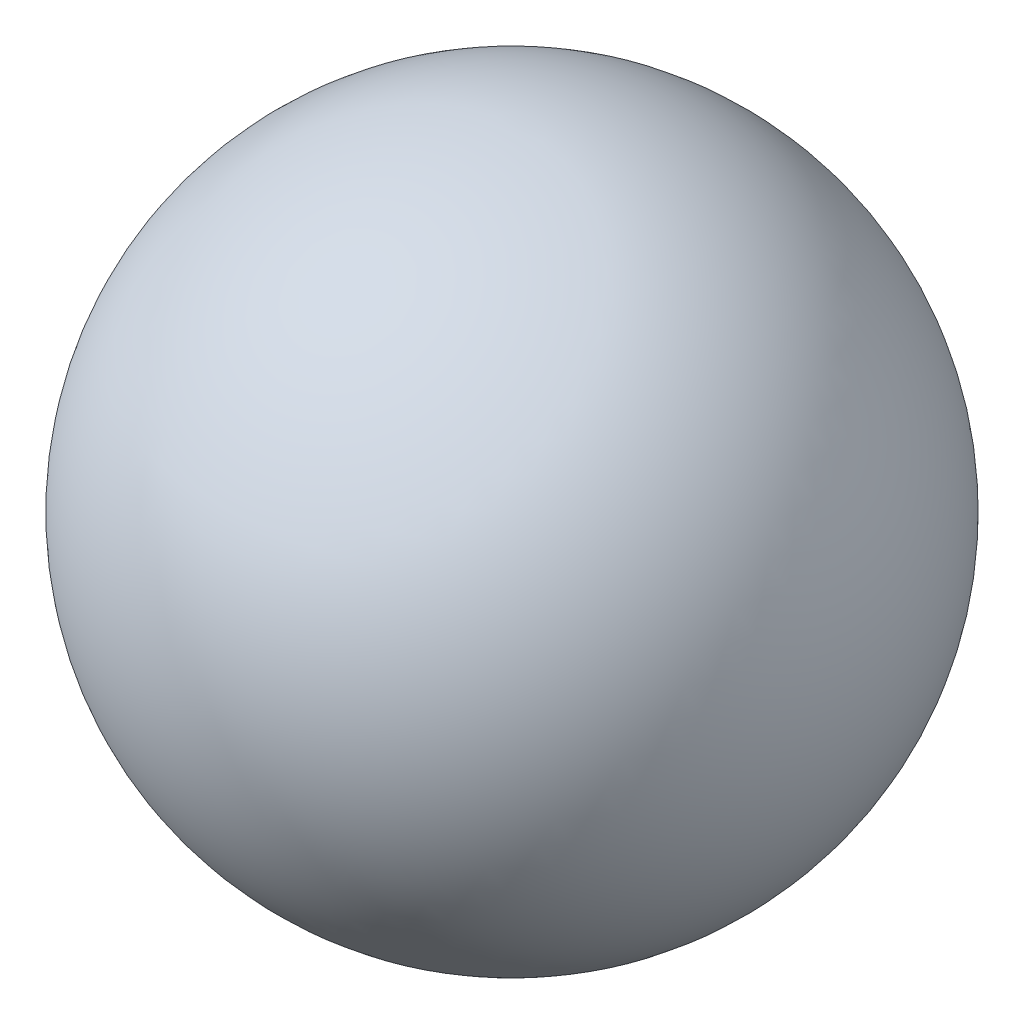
from build123d import *


with BuildPart() as part:
    # Sketch1 → BALL (revolve)
    with BuildSketch(Plane.XY):
        with BuildLine():
            Line((-61.11875, -1.984375), (-61.11875, 1.984375))
            ThreePointArc((-61.11875, 1.984375), (-63.103125, 0), (-61.11875, -1.984375))
        make_face()
    revolve(axis=Axis((-61.11875, -4.906941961, 0), (0, 1, 0)))


solid = part.part
